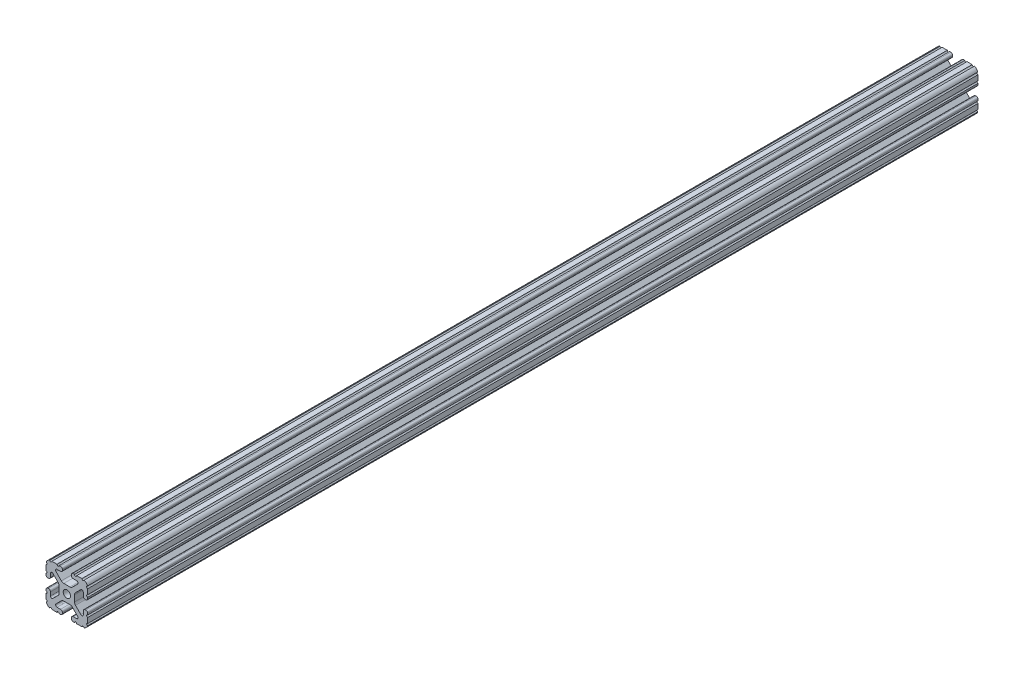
from build123d import *

# Parameters (mm, degrees)
BOSS_EXTRUDE1_DEPTH     = 457.2
CUT_EXTRUDE1_DEPTH      = 458.993062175
CUT_EXTRUDE1_DEPTH_BACK = 458.993062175
SKETCH5_R               = 1.016
SKETCH6_W               = 39.134581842
SKETCH6_H               = 38.977379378
CUT_EXTRUDE2_DEPTH      = 101.6


with BuildPart() as part:
    # Sketch4 → Boss-Extrude1 (new, symmetric)
    with BuildSketch(Plane.XY):
        with BuildLine():
            Line((5.7912, -19.05), (14.3002, -19.05))
            ThreePointArc((14.3002, -19.05), (17.658815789, -17.658815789), (19.05, -14.3002))
            Line((19.05, -14.3002), (19.05, -5.7912))
            ThreePointArc((19.05, -5.7912), (18.544114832, -4.569885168), (17.3228, -4.064))
            Line((17.3228, -4.064), (16.7132, -4.064))
            ThreePointArc((16.7132, -4.064), (15.491885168, -4.569885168), (14.986, -5.7912))
            Line((14.986, -5.7912), (14.986, -8.996305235))
            ThreePointArc((14.986, -8.996305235), (14.189232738, -10.188751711), (12.782646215, -9.908964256))
            Line((12.782646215, -9.908964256), (7.888897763, -5.015215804))
            ThreePointArc((7.888897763, -5.015215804), (7.219915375, -4.014012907), (6.985, -2.833013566))
            Line((6.985, -2.833013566), (6.985, 0))
            Line((6.985, 0), (3.3274, 0))
            ThreePointArc((3.3274, 0), (2.352827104, -2.352827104), (0, -3.3274))
            Line((0, -3.3274), (0, -6.985))
            Line((0, -6.985), (2.833013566, -6.985))
            ThreePointArc((2.833013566, -6.985), (4.014012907, -7.219915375), (5.015215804, -7.888897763))
            Line((5.015215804, -7.888897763), (9.908964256, -12.782646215))
            ThreePointArc((9.908964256, -12.782646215), (10.188751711, -14.189232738), (8.996305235, -14.986))
            Line((8.996305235, -14.986), (5.7912, -14.986))
            ThreePointArc((5.7912, -14.986), (4.569885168, -15.491885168), (4.064, -16.7132))
            Line((4.064, -16.7132), (4.064, -17.3228))
            ThreePointArc((4.064, -17.3228), (4.569885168, -18.544114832), (5.7912, -19.05))
        make_face()
    extrude(amount=BOSS_EXTRUDE1_DEPTH, both=True)

    # Sketch5 → Cut-Extrude1 (cut, two sides: drawn at the far end of the back side and taken through both)
    with BuildSketch(Plane.XY.offset(-CUT_EXTRUDE1_DEPTH_BACK)):
        with Locations((14.739477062, -19.05)):
            Circle(SKETCH5_R)
        with Locations((7.980305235, -19.05)):
            Circle(SKETCH5_R)
        with Locations((19.05, -14.739477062)):
            Circle(SKETCH5_R)
        with Locations((19.05, -7.980305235)):
            Circle(SKETCH5_R)
    extrude(amount=CUT_EXTRUDE1_DEPTH + CUT_EXTRUDE1_DEPTH_BACK, mode=Mode.SUBTRACT)

    # Mirror1: part across plane


with BuildPart() as part_1:
    add(part.part)
    add(part.part.mirror(Plane(origin=(0, 0, 0), x_dir=(0, 0, 1), z_dir=(1, 0, 0))))

    # Mirror2: part across plane


with BuildPart() as part_2:
    add(part_1.part)
    add(part_1.part.mirror(Plane.ZX))

    # Sketch6 → Cut-Extrude2 (cut)
    with BuildSketch(Plane.XY.offset(457.2)):
        Rectangle(SKETCH6_W, SKETCH6_H)
    extrude(amount=-CUT_EXTRUDE2_DEPTH, mode=Mode.SUBTRACT)


solid = part_2.part
